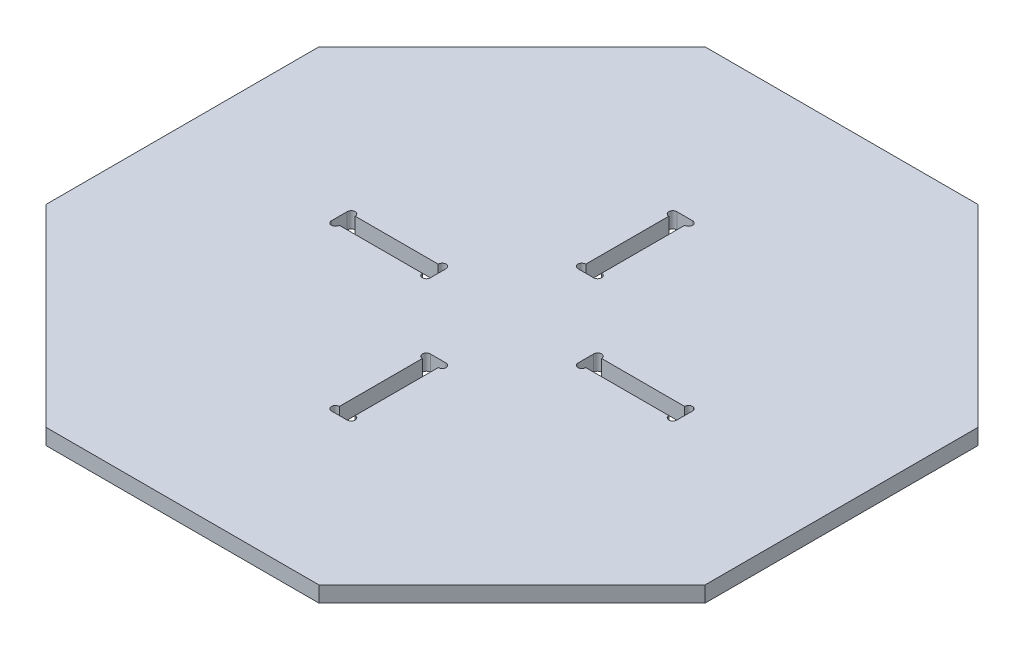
from build123d import *

# Parameters (mm, degrees)
BOSS_EXTRUDE1_DEPTH = 12


with BuildPart() as part:
    # Sketch1 → Boss-Extrude1 (new body)
    with BuildSketch(Plane(origin=(0, 0, 0), x_dir=(1, 0, 0), z_dir=(0, 1, 0))):
        Polygon((-250, -103.553390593), (-103.553390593, -250), (103.553390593, -250), (250, -103.553390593), (250, 103.553390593), (103.553390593, 250), (-103.553390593, 250), (-250, 103.553390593), align=None)
        with BuildLine():
            ThreePointArc((-6, 125), (-9, 128), (-6, 131))
            Line((-6, 131), (6, 131))
            ThreePointArc((6, 131), (9, 128), (6, 125))
            Line((6, 125), (6, 62))
            ThreePointArc((6, 62), (9, 59), (6, 56))
            Line((6, 56), (-6, 56))
            ThreePointArc((-6, 56), (-9, 59), (-6, 62))
            Line((-6, 62), (-6, 125))
        make_face(mode=Mode.SUBTRACT)
        with BuildLine():
            Line((56, -6), (56, 6))
            ThreePointArc((56, 6), (59, 9), (62, 6))
            Line((62, 6), (125, 6))
            ThreePointArc((125, 6), (128, 9), (131, 6))
            Line((131, 6), (131, -6))
            ThreePointArc((131, -6), (128, -9), (125, -6))
            Line((125, -6), (62, -6))
            ThreePointArc((62, -6), (59, -9), (56, -6))
        make_face(mode=Mode.SUBTRACT)
        with BuildLine():
            ThreePointArc((-56, -6), (-59, -9), (-62, -6))
            Line((-62, -6), (-125, -6))
            ThreePointArc((-125, -6), (-128, -9), (-131, -6))
            Line((-131, -6), (-131, 6))
            ThreePointArc((-131, 6), (-128, 9), (-125, 6))
            Line((-125, 6), (-62, 6))
            ThreePointArc((-62, 6), (-59, 9), (-56, 6))
            Line((-56, 6), (-56, -6))
        make_face(mode=Mode.SUBTRACT)
        with BuildLine():
            Line((-6, -131), (6, -131))
            ThreePointArc((6, -131), (9, -128), (6, -125))
            Line((6, -125), (6, -62))
            ThreePointArc((6, -62), (9, -59), (6, -56))
            Line((6, -56), (-6, -56))
            ThreePointArc((-6, -56), (-9, -59), (-6, -62))
            Line((-6, -62), (-6, -125))
            ThreePointArc((-6, -125), (-9, -128), (-6, -131))
        make_face(mode=Mode.SUBTRACT)
    extrude(amount=BOSS_EXTRUDE1_DEPTH)


solid = part.part
